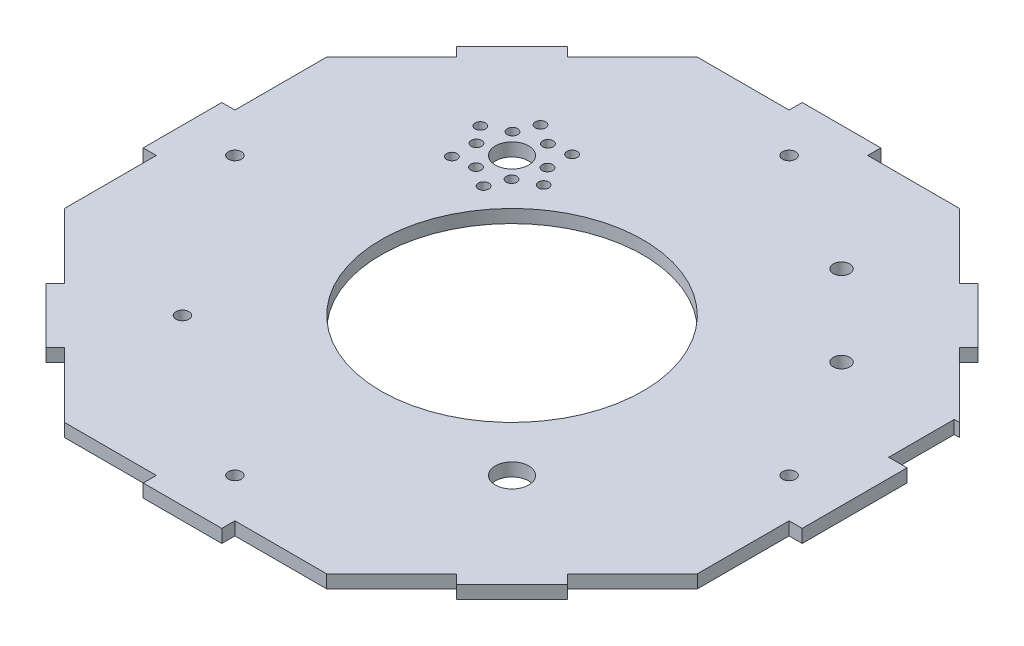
from build123d import *

# Parameters (mm, degrees)
CROQUIS1_R              = 50
CROQUIS1_R_2            = 2.5
CROQUIS1_R_3            = 3.175
CROQUIS1_R_4            = 6.35
SALIENTE_EXTRUIR1_DEPTH = 5
CROQUIS2_R              = 2
CORTAR_EXTRUIR1_DEPTH   = 10


with BuildPart() as part:
    # Croquis1 → Saliente-Extruir1 (new body)
    with BuildSketch(Plane(origin=(0, 0, 0), x_dir=(1, 0, 0), z_dir=(0, 1, 0))):
        Polygon((-30.908981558, -85.661724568), (-30.908981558, -50.661724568), (-35.908981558, -50.661724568), (-35.908981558, -20.661724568), (-30.908981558, -20.661724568), (-30.908981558, 14.338275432), (-6.160244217, 39.087012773), (-9.695778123, 42.622546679), (11.517425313, 63.835750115), (15.052959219, 60.300216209), (39.80169656, 85.04895355), (74.80169656, 85.04895355), (74.80169656, 90.04895355), (104.80169656, 90.04895355), (104.80169656, 85.04895355), (139.80169656, 85.04895355), (164.550433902, 60.300216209), (168.085967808, 63.835750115), (189.299171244, 42.622546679), (185.763637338, 39.087012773), (210.512374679, 14.338275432), (208.512374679, 14.338275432), (208.512374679, -10.661724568), (210.512374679, -10.661724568), (215.512374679, -10.661724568), (215.512374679, -50.661724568), (210.512374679, -50.661724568), (210.512374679, -85.661724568), (185.763637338, -110.41046191), (189.299171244, -113.945995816), (168.085967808, -135.159199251), (164.550433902, -131.623665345), (139.80169656, -156.372402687), (104.80169656, -156.372402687), (104.80169656, -161.372402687), (74.80169656, -161.372402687), (74.80169656, -156.372402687), (39.80169656, -156.372402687), (15.052959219, -131.623665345), (11.517425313, -135.159199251), (-9.695778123, -113.945995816), (-6.160244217, -110.41046191), align=None)
        with Locations(Location((89.80169656, -35.661724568, 0), (0, 0, 270))):
            Circle(CROQUIS1_R, mode=Mode.SUBTRACT)
        with Locations(Location((89.80169656, -141.372402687, 0), (0, 0, 270))):
            Circle(CROQUIS1_R_2, mode=Mode.SUBTRACT)
        with Locations(Location((89.80169656, 70.04895355, 0), (0, 0, 270))):
            Circle(CROQUIS1_R_2, mode=Mode.SUBTRACT)
        with Locations(Location((-15.908981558, -35.661724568, 0), (0, 0, 270))):
            Circle(CROQUIS1_R_2, mode=Mode.SUBTRACT)
        with Locations(Location((195.512374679, -35.661724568, 0), (0, 0, 270))):
            Circle(CROQUIS1_R_2, mode=Mode.SUBTRACT)
        with Locations(Location((26.946357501, -98.517063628, 0), (0, 0, 270))):
            Circle(CROQUIS1_R_2, mode=Mode.SUBTRACT)
        with Locations(Location((137.228103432, 42.622546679, 0), (0, 0, 270))):
            Circle(CROQUIS1_R_3, mode=Mode.SUBTRACT)
        with Locations(Location((36.946357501, 17.193614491, 0), (0, 0, 270))):
            Circle(CROQUIS1_R_4, mode=Mode.SUBTRACT)
        with Locations(Location((142.65703562, -88.517063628, 0), (0, 0, 90))):
            Circle(CROQUIS1_R_4, mode=Mode.SUBTRACT)
        with Locations(Location((168.085967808, 11.764682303, 0), (0, 0, 90))):
            Circle(CROQUIS1_R_3, mode=Mode.SUBTRACT)
    extrude(amount=SALIENTE_EXTRUIR1_DEPTH)

    # Croquis2 → Cortar-Extruir1 (cut)
    with BuildSketch(Plane(origin=(0, 5, 0), x_dir=(1, 0, 0), z_dir=(0, 1, 0))):
        with Locations(Location((29.165165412, 25.147690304, 0), (0, 0, 270))):
            Circle(CROQUIS2_R)
        with Locations(Location((39.944193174, 27.909362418, 0), (0, 0, 270))):
            Circle(CROQUIS2_R)
        with Locations(Location((48.058434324, 29.009430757, 0), (0, 0, 270))):
            Circle(CROQUIS2_R)
        with Locations(Location((47.725385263, 19.955286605, 0), (0, 0, 270))):
            Circle(CROQUIS2_R)
        with Locations(Location((52.735192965, 13.478181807, 0), (0, 0, 270))):
            Circle(CROQUIS2_R)
        with Locations(Location((44.72754959, 9.239538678, 0), (0, 0, 270))):
            Circle(CROQUIS2_R)
        with Locations(Location((41.623116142, 1.662365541, 0), (0, 0, 270))):
            Circle(CROQUIS2_R)
        with Locations(Location((33.948521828, 6.477866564, 0), (0, 0, 270))):
            Circle(CROQUIS2_R)
        with Locations(Location((25.834280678, 5.377798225, 0), (0, 0, 270))):
            Circle(CROQUIS2_R)
        with Locations(Location((26.167329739, 14.431942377, 0), (0, 0, 270))):
            Circle(CROQUIS2_R)
        with Locations(Location((21.157522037, 20.909047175, 0), (0, 0, 270))):
            Circle(CROQUIS2_R)
        with Locations(Location((32.26959886, 32.724863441, 0), (0, 0, 270))):
            Circle(CROQUIS2_R)
    extrude(amount=-CORTAR_EXTRUIR1_DEPTH, mode=Mode.SUBTRACT)


solid = part.part
